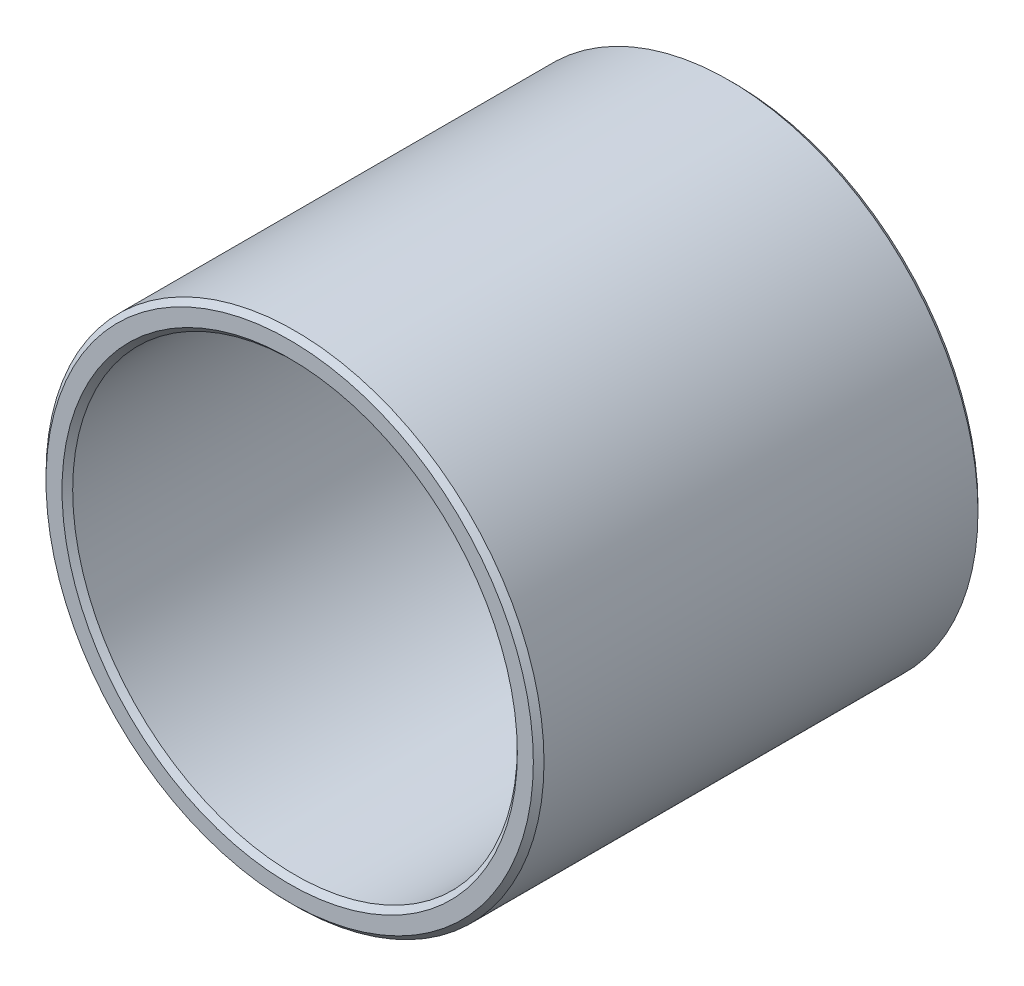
from build123d import *

# Parameters (mm, degrees)
ESQUISSE1_R          = 14
ESQUISSE1_R_2        = 12.5
BASE_EXTRUSION_DEPTH = 25
CHANFREIN1_SIZE      = 0.3


with BuildPart() as part:
    # Esquisse1 → Base-Extrusion (new body)
    with BuildSketch(Plane.XY):
        Circle(ESQUISSE1_R)
        Circle(ESQUISSE1_R_2, mode=Mode.SUBTRACT)
    extrude(amount=-BASE_EXTRUSION_DEPTH)

    # Chanfrein1
    chanfrein1_edges = [part.edges().sort_by_distance(p)[0] for p in [
        (-14, 0, 0),
        (-14, 0, -25),
        (-12.5, 0, 0),
        (-12.5, 0, -25),
    ]]
    chamfer(chanfrein1_edges, length=CHANFREIN1_SIZE)


solid = part.part
